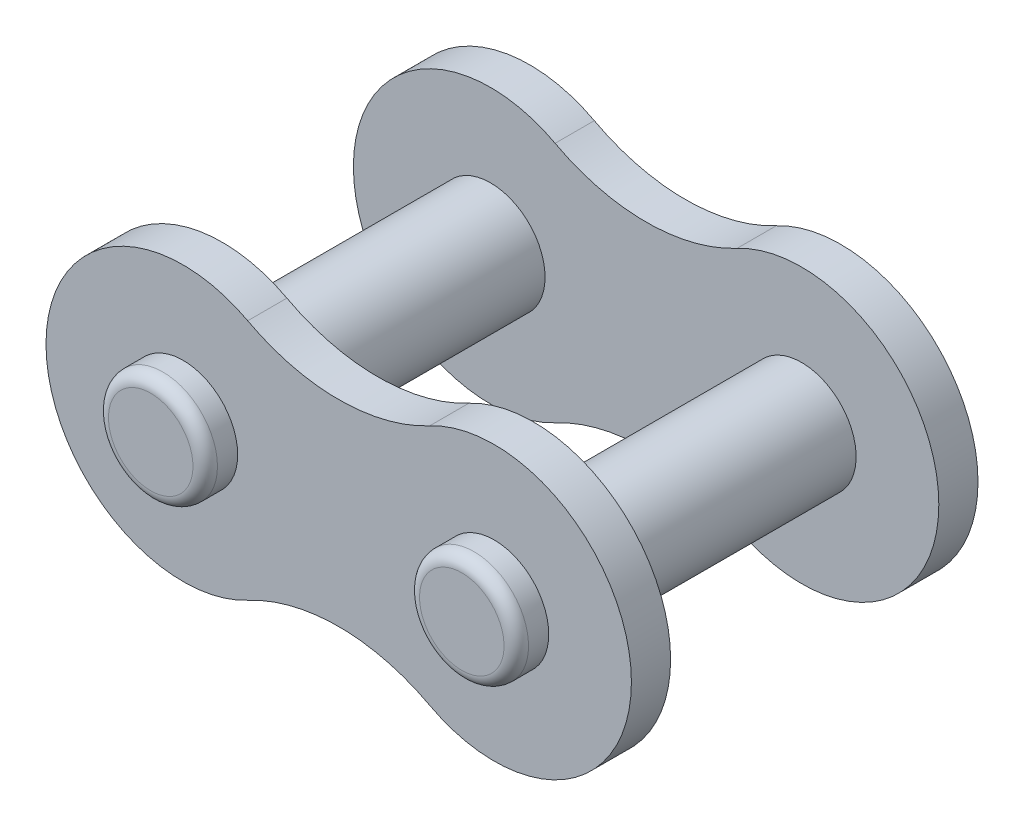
from build123d import *

# Parameters (mm, degrees)
SKETCH3_R           = 2.225
BOSS_EXTRUDE1_DEPTH = 1.6


with BuildPart() as part:
    # Sketch1 → Revolve1 (revolve)
    with BuildSketch(Plane(origin=(0, 0, 0), x_dir=(1, 0, 0), z_dir=(0, 1, 0)), mode=Mode.PRIVATE) as revolve1_sk:
        with BuildLine():
            Line((0, -8.4), (0, 8.4))
            Line((0, 8.4), (1.725, 8.4))
            ThreePointArc((1.725, 8.4), (2.078553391, 8.253553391), (2.225, 7.9))
            Line((2.225, 7.9), (2.225, -7.9))
            ThreePointArc((2.225, -7.9), (2.078553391, -8.253553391), (1.725, -8.4))
            Line((1.725, -8.4), (0, -8.4))
        make_face()
    revolve(revolve1_sk.sketch.rotate(Axis((0, 0, -9.24), (0, 0, 1)), 180), axis=Axis((0, 0, -9.24), (0, 0, 1)))



with BuildPart() as body_2:
    # Sketch2 → Revolve2 (revolve)
    with BuildSketch(Plane.XZ, mode=Mode.PRIVATE) as revolve2_sk:
        with BuildLine():
            Line((-12.7, 8.4), (-14.425, 8.4))
            ThreePointArc((-14.425, 8.4), (-14.778553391, 8.253553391), (-14.925, 7.9))
            Line((-14.925, 7.9), (-14.925, -7.9))
            ThreePointArc((-14.925, -7.9), (-14.778553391, -8.253553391), (-14.425, -8.4))
            Line((-14.425, -8.4), (-12.7, -8.4))
            Line((-12.7, -8.4), (-12.7, 8.4))
        make_face()
    revolve(revolve2_sk.sketch.rotate(Axis((-12.7, 0, 8.4), (0, 0, -1)), 180), axis=Axis((-12.7, 0, 8.4), (0, 0, -1)))


with BuildPart() as part_1:
    add(part.part)

    add(body_2.part)  # Boss-Extrude1 merges body 2
    # Sketch3 → Boss-Extrude1 (add)
    with BuildSketch(Plane(origin=(0, 0, -5.475), x_dir=(0, -1, 0), z_dir=(0, 0, -1))):
        with BuildLine():
            ThreePointArc((-4.941202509, 2.635245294), (0, -5.6), (4.941202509, 2.635245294))
            ThreePointArc((4.941202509, 2.635245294), (4.012533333, 6.35), (4.941202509, 10.064754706))
            ThreePointArc((4.941202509, 10.064754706), (0, 18.3), (-4.941202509, 10.064754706))
            ThreePointArc((-4.941202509, 10.064754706), (-4.012533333, 6.35), (-4.941202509, 2.635245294))
        make_face()
        with Locations(Location((0, 0, 0), (0, 0, 90))):
            Circle(SKETCH3_R, mode=Mode.SUBTRACT)
        with Locations(Location((0, 12.7, 0), (0, 0, 270))):
            Circle(SKETCH3_R, mode=Mode.SUBTRACT)
    boss_extrude1 = extrude(amount=BOSS_EXTRUDE1_DEPTH)

    # Mirror1: Boss-Extrude1 across plane
    add(boss_extrude1.mirror(Plane.XY))


solid = part_1.part
